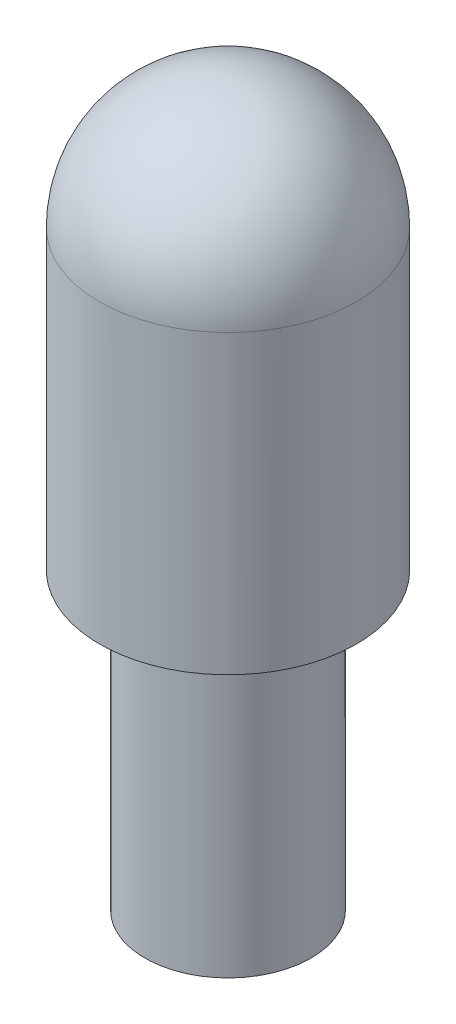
from build123d import *

# Parameters (mm, degrees)
FILLET1_R = 0.254


with BuildPart() as part:
    # Sketch1 → Revolve1 (revolve)
    with BuildSketch(Plane.XY, mode=Mode.PRIVATE) as revolve1_sk:
        with BuildLine():
            Line((0, 0), (1.2319, 0))
            Line((1.2319, 0), (1.2319, 4.3688))
            Line((1.2319, 4.3688), (1.905, 4.3688))
            Line((1.905, 4.3688), (1.905, 8.763))
            ThreePointArc((1.905, 8.763), (1.347038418, 10.110038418), (0, 10.668))
            Line((0, 10.668), (0, 0))
        make_face()
    revolve(revolve1_sk.sketch.rotate(Axis((0, 0, 0), (0, 1, 0)), 90), axis=Axis((0, 0, 0), (0, 1, 0)))

    # Fillet1
    fillet1_edges = [part.edges().sort_by_distance(p)[0] for p in [
        (0, 4.3688, 1.2319),
    ]]
    fillet(fillet1_edges, radius=FILLET1_R)


solid = part.part
